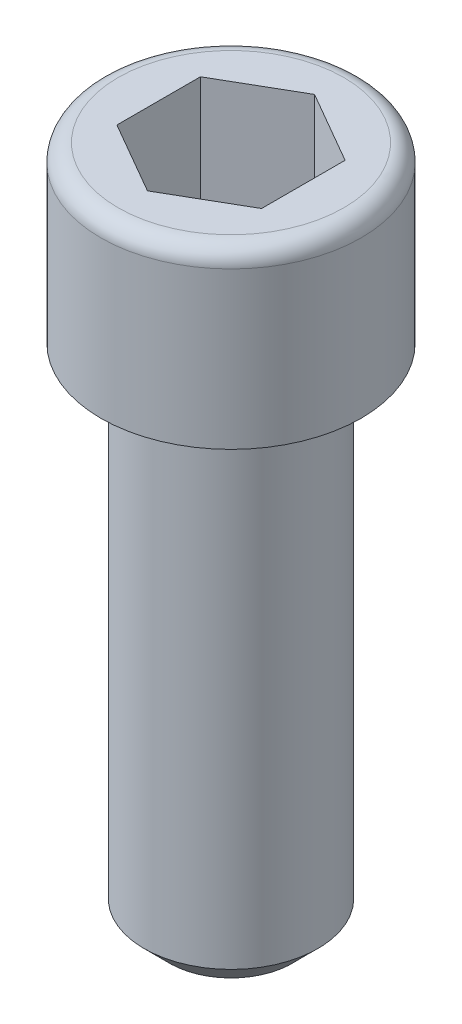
from build123d import *

# Parameters (mm, degrees)
EMPREINTE_DEPTH = 8.64


with BuildPart() as part:
    # E_corps → corps (revolve)
    with BuildSketch(Plane.XY, mode=Mode.PRIVATE) as corps_sk:
        with BuildLine():
            Line((6, -12), (9, -12))
            Line((9, -12), (9, -1.2))
            ThreePointArc((9, -1.2), (8.648528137, -0.351471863), (7.8, 0))
            Line((7.8, 0), (0, 0))
            Line((0, 0), (0, -47))
            Line((0, -47), (4.25, -47))
            Line((4.25, -47), (6, -45.25))
            Line((6, -45.25), (6, -12))
        make_face()
    revolve(corps_sk.sketch.rotate(Axis((0, 65.117292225, 0), (0, -1, 0)), 180), axis=Axis((0, 65.117292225, 0), (0, -1, 0)))

    # E_empreinte → Empreinte (cut)
    with BuildSketch(Plane(origin=(0, 0, 0), x_dir=(-1, 0, 0), z_dir=(0, 1, 0))):
        Polygon((0, -5.773502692), (-5, -2.886751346), (-5, 2.886751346), (0, 5.773502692), (5, 2.886751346), (5, -2.886751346), align=None)
    extrude(amount=-EMPREINTE_DEPTH, mode=Mode.SUBTRACT)


solid = part.part
